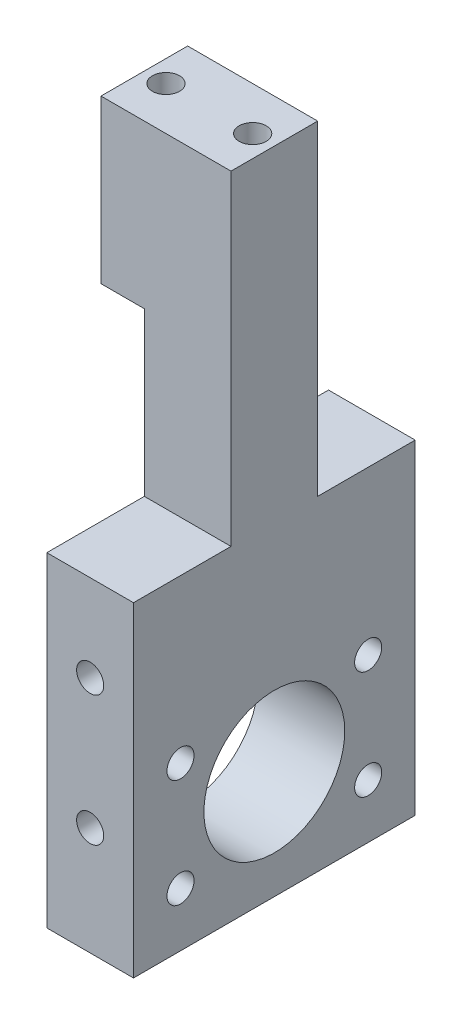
ISO-10303-21;
HEADER;
FILE_DESCRIPTION(('STEP AP214'),'2;1');
FILE_NAME('part.step','',(''),(''),'','','');
FILE_SCHEMA(('AUTOMOTIVE_DESIGN { 1 0 10303 214 1 1 1 1 }'));
ENDSEC;
DATA;
#1=APPLICATION_CONTEXT('core data for automotive mechanical design processes');
#2=APPLICATION_PROTOCOL_DEFINITION('international standard','automotive_design',2000,#1);
#3=PRODUCT_CONTEXT('',#1,'mechanical');
#4=PRODUCT('Part','Part','',(#3));
#5=PRODUCT_RELATED_PRODUCT_CATEGORY('part','',(#4));
#6=PRODUCT_DEFINITION_FORMATION('','',#4);
#7=PRODUCT_DEFINITION_CONTEXT('part definition',#1,'design');
#8=PRODUCT_DEFINITION('design','',#6,#7);
#9=PRODUCT_DEFINITION_SHAPE('','',#8);
#10=(LENGTH_UNIT() NAMED_UNIT(*) SI_UNIT(.MILLI.,.METRE.));
#11=(NAMED_UNIT(*) PLANE_ANGLE_UNIT() SI_UNIT($,.RADIAN.));
#12=(NAMED_UNIT(*) SI_UNIT($,.STERADIAN.) SOLID_ANGLE_UNIT());
#13=UNCERTAINTY_MEASURE_WITH_UNIT(LENGTH_MEASURE(1.E-05),#10,'distance_accuracy_value','');
#14=(GEOMETRIC_REPRESENTATION_CONTEXT(3) GLOBAL_UNCERTAINTY_ASSIGNED_CONTEXT((#13)) GLOBAL_UNIT_ASSIGNED_CONTEXT((#10,
#11,#12)) REPRESENTATION_CONTEXT('',''));
#15=CARTESIAN_POINT('',(0.,0.,0.));
#16=DIRECTION('',(0.,0.,1.));
#17=DIRECTION('',(1.,0.,0.));
#18=AXIS2_PLACEMENT_3D('',#15,#16,#17);
#19=CARTESIAN_POINT('',(12.,0.,0.));
#20=DIRECTION('',(1.,0.,0.));
#21=DIRECTION('',(0.,0.,-1.));
#22=AXIS2_PLACEMENT_3D('',#19,#20,#21);
#23=PLANE('',#22);
#24=CARTESIAN_POINT('',(12.,5.00000000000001,8.6602540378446));
#25=DIRECTION('',(1.,0.,0.));
#26=DIRECTION('',(0.,0.,-1.));
#27=AXIS2_PLACEMENT_3D('',#24,#25,#26);
#28=CIRCLE('',#27,1.24999999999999);
#29=CARTESIAN_POINT('',(12.,5.00000000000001,7.41025403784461));
#30=VERTEX_POINT('',#29);
#31=EDGE_CURVE('E171',#30,#30,#28,.T.);
#32=ORIENTED_EDGE('',*,*,#31,.F.);
#33=EDGE_LOOP('',(#32));
#34=FACE_BOUND('',#33,.T.);
#35=CARTESIAN_POINT('',(12.,-5.00000000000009,8.66025403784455));
#36=DIRECTION('',(1.,0.,0.));
#37=DIRECTION('',(0.,0.,-1.));
#38=AXIS2_PLACEMENT_3D('',#35,#36,#37);
#39=CIRCLE('',#38,1.24999999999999);
#40=CARTESIAN_POINT('',(12.,-5.00000000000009,7.41025403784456));
#41=VERTEX_POINT('',#40);
#42=EDGE_CURVE('E168',#41,#41,#39,.T.);
#43=ORIENTED_EDGE('',*,*,#42,.F.);
#44=EDGE_LOOP('',(#43));
#45=FACE_BOUND('',#44,.T.);
#46=CARTESIAN_POINT('',(12.,-5.,-8.6602540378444));
#47=DIRECTION('',(1.,0.,0.));
#48=DIRECTION('',(0.,0.,-1.));
#49=AXIS2_PLACEMENT_3D('',#46,#47,#48);
#50=CIRCLE('',#49,1.24999999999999);
#51=CARTESIAN_POINT('',(12.,-5.,-9.91025403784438));
#52=VERTEX_POINT('',#51);
#53=EDGE_CURVE('E165',#52,#52,#50,.T.);
#54=ORIENTED_EDGE('',*,*,#53,.F.);
#55=EDGE_LOOP('',(#54));
#56=FACE_BOUND('',#55,.T.);
#57=CARTESIAN_POINT('',(12.,5.,-8.6602540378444));
#58=DIRECTION('',(1.,0.,0.));
#59=DIRECTION('',(0.,0.,-1.));
#60=AXIS2_PLACEMENT_3D('',#57,#58,#59);
#61=CIRCLE('',#60,1.24999999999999);
#62=CARTESIAN_POINT('',(12.,5.,-9.91025403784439));
#63=VERTEX_POINT('',#62);
#64=EDGE_CURVE('E161',#63,#63,#61,.T.);
#65=ORIENTED_EDGE('',*,*,#64,.F.);
#66=EDGE_LOOP('',(#65));
#67=FACE_BOUND('',#66,.T.);
#68=DIRECTION('',(0.,-1.,0.));
#69=VECTOR('',#68,1.);
#70=CARTESIAN_POINT('',(12.,20.,13.));
#71=LINE('',#70,#69);
#72=CARTESIAN_POINT('',(12.,20.,13.));
#73=VERTEX_POINT('',#72);
#74=CARTESIAN_POINT('',(12.,-10.,13.));
#75=VERTEX_POINT('',#74);
#76=EDGE_CURVE('E137',#73,#75,#71,.T.);
#77=ORIENTED_EDGE('',*,*,#76,.T.);
#78=DIRECTION('',(0.,0.,-1.));
#79=VECTOR('',#78,1.);
#80=CARTESIAN_POINT('',(12.,-10.,13.));
#81=LINE('',#80,#79);
#82=CARTESIAN_POINT('',(12.,-10.,-13.));
#83=VERTEX_POINT('',#82);
#84=EDGE_CURVE('E91',#75,#83,#81,.T.);
#85=ORIENTED_EDGE('',*,*,#84,.T.);
#86=DIRECTION('',(0.,1.,0.));
#87=VECTOR('',#86,1.);
#88=CARTESIAN_POINT('',(12.,20.,-13.));
#89=LINE('',#88,#87);
#90=CARTESIAN_POINT('',(12.,20.,-13.));
#91=VERTEX_POINT('',#90);
#92=EDGE_CURVE('E229',#83,#91,#89,.T.);
#93=ORIENTED_EDGE('',*,*,#92,.T.);
#94=DIRECTION('',(0.,0.,1.));
#95=VECTOR('',#94,1.);
#96=CARTESIAN_POINT('',(12.,20.,-4.));
#97=LINE('',#96,#95);
#98=CARTESIAN_POINT('',(12.,20.,-4.));
#99=VERTEX_POINT('',#98);
#100=EDGE_CURVE('E231',#91,#99,#97,.T.);
#101=ORIENTED_EDGE('',*,*,#100,.T.);
#102=DIRECTION('',(0.,1.,0.));
#103=VECTOR('',#102,1.);
#104=CARTESIAN_POINT('',(12.,50.,-4.));
#105=LINE('',#104,#103);
#106=CARTESIAN_POINT('',(12.,50.,-4.));
#107=VERTEX_POINT('',#106);
#108=EDGE_CURVE('E112',#99,#107,#105,.T.);
#109=ORIENTED_EDGE('',*,*,#108,.T.);
#110=DIRECTION('',(0.,0.,1.));
#111=VECTOR('',#110,1.);
#112=CARTESIAN_POINT('',(12.,50.,4.));
#113=LINE('',#112,#111);
#114=CARTESIAN_POINT('',(12.,50.,4.));
#115=VERTEX_POINT('',#114);
#116=EDGE_CURVE('E106',#107,#115,#113,.T.);
#117=ORIENTED_EDGE('',*,*,#116,.T.);
#118=DIRECTION('',(0.,-1.,0.));
#119=VECTOR('',#118,1.);
#120=CARTESIAN_POINT('',(12.,20.,4.));
#121=LINE('',#120,#119);
#122=CARTESIAN_POINT('',(12.,20.,4.));
#123=VERTEX_POINT('',#122);
#124=EDGE_CURVE('E109',#115,#123,#121,.T.);
#125=ORIENTED_EDGE('',*,*,#124,.T.);
#126=DIRECTION('',(0.,0.,1.));
#127=VECTOR('',#126,1.);
#128=CARTESIAN_POINT('',(12.,20.,13.));
#129=LINE('',#128,#127);
#130=EDGE_CURVE('E66',#123,#73,#129,.T.);
#131=ORIENTED_EDGE('',*,*,#130,.T.);
#132=EDGE_LOOP('',(#77,#85,#93,#101,#109,#117,#125,#131));
#133=FACE_BOUND('',#132,.T.);
#134=CARTESIAN_POINT('',(12.,0.,0.));
#135=DIRECTION('',(1.,0.,0.));
#136=DIRECTION('',(0.,0.,-1.));
#137=AXIS2_PLACEMENT_3D('',#134,#135,#136);
#138=CIRCLE('',#137,6.5);
#139=CARTESIAN_POINT('',(12.,0.,-6.5));
#140=VERTEX_POINT('',#139);
#141=EDGE_CURVE('E133',#140,#140,#138,.T.);
#142=ORIENTED_EDGE('',*,*,#141,.F.);
#143=EDGE_LOOP('',(#142));
#144=FACE_BOUND('',#143,.T.);
#145=ADVANCED_FACE('F36',(#34,#45,#56,#67,#133,#144),#23,.T.);
#146=CARTESIAN_POINT('',(0.,0.,0.));
#147=DIRECTION('',(1.,0.,0.));
#148=DIRECTION('',(0.,0.,-1.));
#149=AXIS2_PLACEMENT_3D('',#146,#147,#148);
#150=PLANE('',#149);
#151=DIRECTION('',(0.,1.,0.));
#152=VECTOR('',#151,1.);
#153=CARTESIAN_POINT('',(0.,50.,-4.));
#154=LINE('',#153,#152);
#155=CARTESIAN_POINT('',(0.,35.,-4.));
#156=VERTEX_POINT('',#155);
#157=CARTESIAN_POINT('',(0.,50.,-4.));
#158=VERTEX_POINT('',#157);
#159=EDGE_CURVE('E131',#156,#158,#154,.T.);
#160=ORIENTED_EDGE('',*,*,#159,.F.);
#161=DIRECTION('',(0.,0.,-1.));
#162=VECTOR('',#161,1.);
#163=CARTESIAN_POINT('',(0.,35.,13.));
#164=LINE('',#163,#162);
#165=CARTESIAN_POINT('',(0.,35.,4.));
#166=VERTEX_POINT('',#165);
#167=EDGE_CURVE('E191',#166,#156,#164,.T.);
#168=ORIENTED_EDGE('',*,*,#167,.F.);
#169=DIRECTION('',(0.,-1.,0.));
#170=VECTOR('',#169,1.);
#171=CARTESIAN_POINT('',(0.,20.,4.));
#172=LINE('',#171,#170);
#173=CARTESIAN_POINT('',(0.,50.,4.));
#174=VERTEX_POINT('',#173);
#175=EDGE_CURVE('E135',#174,#166,#172,.T.);
#176=ORIENTED_EDGE('',*,*,#175,.F.);
#177=DIRECTION('',(0.,0.,1.));
#178=VECTOR('',#177,1.);
#179=CARTESIAN_POINT('',(0.,50.,4.));
#180=LINE('',#179,#178);
#181=EDGE_CURVE('E82',#158,#174,#180,.T.);
#182=ORIENTED_EDGE('',*,*,#181,.F.);
#183=EDGE_LOOP('',(#160,#168,#176,#182));
#184=FACE_BOUND('',#183,.T.);
#185=ADVANCED_FACE('F244',(#184),#150,.F.);
#186=CARTESIAN_POINT('',(12.,20.,13.));
#187=DIRECTION('',(0.,0.,-1.));
#188=DIRECTION('',(0.,1.,0.));
#189=AXIS2_PLACEMENT_3D('',#186,#187,#188);
#190=PLANE('',#189);
#191=CARTESIAN_POINT('',(8.00000000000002,0.,13.));
#192=DIRECTION('',(0.,0.,1.));
#193=DIRECTION('',(1.,0.,0.));
#194=AXIS2_PLACEMENT_3D('',#191,#192,#193);
#195=CIRCLE('',#194,1.24999999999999);
#196=CARTESIAN_POINT('',(9.25000000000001,0.,13.));
#197=VERTEX_POINT('',#196);
#198=EDGE_CURVE('E335',#197,#197,#195,.T.);
#199=ORIENTED_EDGE('',*,*,#198,.F.);
#200=EDGE_LOOP('',(#199));
#201=FACE_BOUND('',#200,.T.);
#202=CARTESIAN_POINT('',(8.00000000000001,12.,13.));
#203=DIRECTION('',(0.,0.,1.));
#204=DIRECTION('',(1.,0.,0.));
#205=AXIS2_PLACEMENT_3D('',#202,#203,#204);
#206=CIRCLE('',#205,1.24999999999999);
#207=CARTESIAN_POINT('',(9.25,12.,13.));
#208=VERTEX_POINT('',#207);
#209=EDGE_CURVE('E182',#208,#208,#206,.T.);
#210=ORIENTED_EDGE('',*,*,#209,.F.);
#211=EDGE_LOOP('',(#210));
#212=FACE_BOUND('',#211,.T.);
#213=DIRECTION('',(-1.,0.,0.));
#214=VECTOR('',#213,1.);
#215=CARTESIAN_POINT('',(12.,20.,13.));
#216=LINE('',#215,#214);
#217=CARTESIAN_POINT('',(4.,20.,13.));
#218=VERTEX_POINT('',#217);
#219=EDGE_CURVE('E127',#73,#218,#216,.T.);
#220=ORIENTED_EDGE('',*,*,#219,.T.);
#221=DIRECTION('',(0.,-1.,0.));
#222=VECTOR('',#221,1.);
#223=CARTESIAN_POINT('',(4.,-10.,13.));
#224=LINE('',#223,#222);
#225=CARTESIAN_POINT('',(4.,-10.,13.));
#226=VERTEX_POINT('',#225);
#227=EDGE_CURVE('E57',#218,#226,#224,.T.);
#228=ORIENTED_EDGE('',*,*,#227,.T.);
#229=DIRECTION('',(-1.,0.,0.));
#230=VECTOR('',#229,1.);
#231=CARTESIAN_POINT('',(12.,-10.,13.));
#232=LINE('',#231,#230);
#233=EDGE_CURVE('E49',#75,#226,#232,.T.);
#234=ORIENTED_EDGE('',*,*,#233,.F.);
#235=ORIENTED_EDGE('',*,*,#76,.F.);
#236=EDGE_LOOP('',(#220,#228,#234,#235));
#237=FACE_BOUND('',#236,.T.);
#238=ADVANCED_FACE('F38',(#201,#212,#237),#190,.F.);
#239=CARTESIAN_POINT('',(12.,-10.,13.));
#240=DIRECTION('',(0.,1.,0.));
#241=DIRECTION('',(0.,0.,1.));
#242=AXIS2_PLACEMENT_3D('',#239,#240,#241);
#243=PLANE('',#242);
#244=ORIENTED_EDGE('',*,*,#233,.T.);
#245=DIRECTION('',(0.,0.,-1.));
#246=VECTOR('',#245,1.);
#247=CARTESIAN_POINT('',(4.,-10.,13.));
#248=LINE('',#247,#246);
#249=CARTESIAN_POINT('',(4.,-10.,-13.));
#250=VERTEX_POINT('',#249);
#251=EDGE_CURVE('E155',#226,#250,#248,.T.);
#252=ORIENTED_EDGE('',*,*,#251,.T.);
#253=DIRECTION('',(-1.,0.,0.));
#254=VECTOR('',#253,1.);
#255=CARTESIAN_POINT('',(12.,-10.,-13.));
#256=LINE('',#255,#254);
#257=EDGE_CURVE('E148',#83,#250,#256,.T.);
#258=ORIENTED_EDGE('',*,*,#257,.F.);
#259=ORIENTED_EDGE('',*,*,#84,.F.);
#260=EDGE_LOOP('',(#244,#252,#258,#259));
#261=FACE_BOUND('',#260,.T.);
#262=ADVANCED_FACE('F342',(#261),#243,.F.);
#263=CARTESIAN_POINT('',(12.,20.,-13.));
#264=DIRECTION('',(0.,0.,1.));
#265=DIRECTION('',(1.,0.,0.));
#266=AXIS2_PLACEMENT_3D('',#263,#264,#265);
#267=PLANE('',#266);
#268=ORIENTED_EDGE('',*,*,#257,.T.);
#269=DIRECTION('',(0.,-1.,0.));
#270=VECTOR('',#269,1.);
#271=CARTESIAN_POINT('',(4.,-10.,-13.));
#272=LINE('',#271,#270);
#273=CARTESIAN_POINT('',(4.,20.,-13.));
#274=VERTEX_POINT('',#273);
#275=EDGE_CURVE('E160',#274,#250,#272,.T.);
#276=ORIENTED_EDGE('',*,*,#275,.F.);
#277=DIRECTION('',(-1.,0.,0.));
#278=VECTOR('',#277,1.);
#279=CARTESIAN_POINT('',(12.,20.,-13.));
#280=LINE('',#279,#278);
#281=EDGE_CURVE('E145',#91,#274,#280,.T.);
#282=ORIENTED_EDGE('',*,*,#281,.F.);
#283=ORIENTED_EDGE('',*,*,#92,.F.);
#284=EDGE_LOOP('',(#268,#276,#282,#283));
#285=FACE_BOUND('',#284,.T.);
#286=ADVANCED_FACE('F348',(#285),#267,.F.);
#287=CARTESIAN_POINT('',(12.,20.,-4.));
#288=DIRECTION('',(0.,-1.,0.));
#289=DIRECTION('',(0.,0.,-1.));
#290=AXIS2_PLACEMENT_3D('',#287,#288,#289);
#291=PLANE('',#290);
#292=ORIENTED_EDGE('',*,*,#281,.T.);
#293=DIRECTION('',(0.,0.,1.));
#294=VECTOR('',#293,1.);
#295=CARTESIAN_POINT('',(4.,20.,-4.));
#296=LINE('',#295,#294);
#297=CARTESIAN_POINT('',(4.,20.,-4.));
#298=VERTEX_POINT('',#297);
#299=EDGE_CURVE('E207',#274,#298,#296,.T.);
#300=ORIENTED_EDGE('',*,*,#299,.T.);
#301=DIRECTION('',(-1.,0.,0.));
#302=VECTOR('',#301,1.);
#303=CARTESIAN_POINT('',(12.,20.,-4.));
#304=LINE('',#303,#302);
#305=EDGE_CURVE('E142',#99,#298,#304,.T.);
#306=ORIENTED_EDGE('',*,*,#305,.F.);
#307=ORIENTED_EDGE('',*,*,#100,.F.);
#308=EDGE_LOOP('',(#292,#300,#306,#307));
#309=FACE_BOUND('',#308,.T.);
#310=ADVANCED_FACE('F237',(#309),#291,.F.);
#311=CARTESIAN_POINT('',(12.,50.,-4.));
#312=DIRECTION('',(0.,0.,1.));
#313=DIRECTION('',(0.,-1.,0.));
#314=AXIS2_PLACEMENT_3D('',#311,#312,#313);
#315=PLANE('',#314);
#316=ORIENTED_EDGE('',*,*,#305,.T.);
#317=DIRECTION('',(0.,1.,0.));
#318=VECTOR('',#317,1.);
#319=CARTESIAN_POINT('',(4.,50.,-4.));
#320=LINE('',#319,#318);
#321=CARTESIAN_POINT('',(4.,35.,-4.));
#322=VERTEX_POINT('',#321);
#323=EDGE_CURVE('E204',#298,#322,#320,.T.);
#324=ORIENTED_EDGE('',*,*,#323,.T.);
#325=DIRECTION('',(-1.,0.,0.));
#326=VECTOR('',#325,1.);
#327=CARTESIAN_POINT('',(12.,35.,-4.));
#328=LINE('',#327,#326);
#329=EDGE_CURVE('E210',#322,#156,#328,.T.);
#330=ORIENTED_EDGE('',*,*,#329,.T.);
#331=ORIENTED_EDGE('',*,*,#159,.T.);
#332=DIRECTION('',(-1.,0.,0.));
#333=VECTOR('',#332,1.);
#334=CARTESIAN_POINT('',(12.,50.,-4.));
#335=LINE('',#334,#333);
#336=EDGE_CURVE('E120',#107,#158,#335,.T.);
#337=ORIENTED_EDGE('',*,*,#336,.F.);
#338=ORIENTED_EDGE('',*,*,#108,.F.);
#339=EDGE_LOOP('',(#316,#324,#330,#331,#337,#338));
#340=FACE_BOUND('',#339,.T.);
#341=ADVANCED_FACE('F241',(#340),#315,.F.);
#342=CARTESIAN_POINT('',(12.,50.,4.));
#343=DIRECTION('',(0.,-1.,0.));
#344=DIRECTION('',(0.,0.,-1.));
#345=AXIS2_PLACEMENT_3D('',#342,#343,#344);
#346=PLANE('',#345);
#347=CARTESIAN_POINT('',(2.,50.,0.));
#348=DIRECTION('',(0.,1.,0.));
#349=DIRECTION('',(0.,0.,1.));
#350=AXIS2_PLACEMENT_3D('',#347,#348,#349);
#351=CIRCLE('',#350,1.25);
#352=CARTESIAN_POINT('',(2.,50.,1.25));
#353=VERTEX_POINT('',#352);
#354=EDGE_CURVE('E213',#353,#353,#351,.T.);
#355=ORIENTED_EDGE('',*,*,#354,.F.);
#356=EDGE_LOOP('',(#355));
#357=FACE_BOUND('',#356,.T.);
#358=CARTESIAN_POINT('',(10.,50.,0.));
#359=DIRECTION('',(0.,1.,0.));
#360=DIRECTION('',(0.,0.,1.));
#361=AXIS2_PLACEMENT_3D('',#358,#359,#360);
#362=CIRCLE('',#361,1.25);
#363=CARTESIAN_POINT('',(10.,50.,1.25));
#364=VERTEX_POINT('',#363);
#365=EDGE_CURVE('E219',#364,#364,#362,.T.);
#366=ORIENTED_EDGE('',*,*,#365,.F.);
#367=EDGE_LOOP('',(#366));
#368=FACE_BOUND('',#367,.T.);
#369=ORIENTED_EDGE('',*,*,#181,.T.);
#370=DIRECTION('',(-1.,0.,0.));
#371=VECTOR('',#370,1.);
#372=CARTESIAN_POINT('',(12.,50.,4.));
#373=LINE('',#372,#371);
#374=EDGE_CURVE('E115',#115,#174,#373,.T.);
#375=ORIENTED_EDGE('',*,*,#374,.F.);
#376=ORIENTED_EDGE('',*,*,#116,.F.);
#377=ORIENTED_EDGE('',*,*,#336,.T.);
#378=EDGE_LOOP('',(#369,#375,#376,#377));
#379=FACE_BOUND('',#378,.T.);
#380=ADVANCED_FACE('F116',(#357,#368,#379),#346,.F.);
#381=CARTESIAN_POINT('',(12.,20.,4.));
#382=DIRECTION('',(0.,0.,-1.));
#383=DIRECTION('',(0.,1.,0.));
#384=AXIS2_PLACEMENT_3D('',#381,#382,#383);
#385=PLANE('',#384);
#386=DIRECTION('',(1.,0.,0.));
#387=VECTOR('',#386,1.);
#388=CARTESIAN_POINT('',(12.,35.,4.));
#389=LINE('',#388,#387);
#390=CARTESIAN_POINT('',(4.,35.,4.));
#391=VERTEX_POINT('',#390);
#392=EDGE_CURVE('E11',#166,#391,#389,.T.);
#393=ORIENTED_EDGE('',*,*,#392,.T.);
#394=DIRECTION('',(0.,-1.,0.));
#395=VECTOR('',#394,1.);
#396=CARTESIAN_POINT('',(4.,20.,4.));
#397=LINE('',#396,#395);
#398=CARTESIAN_POINT('',(4.,20.,4.));
#399=VERTEX_POINT('',#398);
#400=EDGE_CURVE('E202',#391,#399,#397,.T.);
#401=ORIENTED_EDGE('',*,*,#400,.T.);
#402=DIRECTION('',(-1.,0.,0.));
#403=VECTOR('',#402,1.);
#404=CARTESIAN_POINT('',(12.,20.,4.));
#405=LINE('',#404,#403);
#406=EDGE_CURVE('E121',#123,#399,#405,.T.);
#407=ORIENTED_EDGE('',*,*,#406,.F.);
#408=ORIENTED_EDGE('',*,*,#124,.F.);
#409=ORIENTED_EDGE('',*,*,#374,.T.);
#410=ORIENTED_EDGE('',*,*,#175,.T.);
#411=EDGE_LOOP('',(#393,#401,#407,#408,#409,#410));
#412=FACE_BOUND('',#411,.T.);
#413=ADVANCED_FACE('F123',(#412),#385,.F.);
#414=CARTESIAN_POINT('',(12.,20.,13.));
#415=DIRECTION('',(0.,-1.,0.));
#416=DIRECTION('',(0.,0.,-1.));
#417=AXIS2_PLACEMENT_3D('',#414,#415,#416);
#418=PLANE('',#417);
#419=ORIENTED_EDGE('',*,*,#406,.T.);
#420=DIRECTION('',(0.,0.,1.));
#421=VECTOR('',#420,1.);
#422=CARTESIAN_POINT('',(4.,20.,13.));
#423=LINE('',#422,#421);
#424=EDGE_CURVE('E154',#399,#218,#423,.T.);
#425=ORIENTED_EDGE('',*,*,#424,.T.);
#426=ORIENTED_EDGE('',*,*,#219,.F.);
#427=ORIENTED_EDGE('',*,*,#130,.F.);
#428=EDGE_LOOP('',(#419,#425,#426,#427));
#429=FACE_BOUND('',#428,.T.);
#430=ADVANCED_FACE('F284',(#429),#418,.F.);
#431=CARTESIAN_POINT('',(12.,0.,0.));
#432=DIRECTION('',(-1.,0.,0.));
#433=DIRECTION('',(0.,0.,1.));
#434=AXIS2_PLACEMENT_3D('',#431,#432,#433);
#435=CYLINDRICAL_SURFACE('',#434,6.5);
#436=CARTESIAN_POINT('',(9.25000000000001,0.,6.5));
#437=CARTESIAN_POINT('',(9.24999737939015,-0.0695263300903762,6.49999873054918));
#438=CARTESIAN_POINT('',(9.24417970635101,-0.139086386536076,6.49887299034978));
#439=CARTESIAN_POINT('',(9.2210790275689,-0.276244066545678,6.49449072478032));
#440=CARTESIAN_POINT('',(9.203786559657,-0.343840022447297,6.49123244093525));
#441=CARTESIAN_POINT('',(9.15828720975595,-0.475066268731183,6.48294932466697));
#442=CARTESIAN_POINT('',(9.1300904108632,-0.538700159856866,6.47792612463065));
#443=CARTESIAN_POINT('',(9.06361193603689,-0.660328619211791,6.46666077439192));
#444=CARTESIAN_POINT('',(9.02533099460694,-0.71832359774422,6.46041871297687));
#445=CARTESIAN_POINT('',(8.93926041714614,-0.827762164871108,6.44731615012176));
#446=CARTESIAN_POINT('',(8.89136858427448,-0.879124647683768,6.44044947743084));
#447=CARTESIAN_POINT('',(8.7876554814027,-0.973138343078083,6.42691706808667));
#448=CARTESIAN_POINT('',(8.73183362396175,-1.01578890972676,6.42025134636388));
#449=CARTESIAN_POINT('',(8.61326800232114,-1.09150839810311,6.4078154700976));
#450=CARTESIAN_POINT('',(8.55047028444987,-1.12449425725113,6.40205326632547));
#451=CARTESIAN_POINT('',(8.42009504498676,-1.17941610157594,6.39216406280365));
#452=CARTESIAN_POINT('',(8.35251795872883,-1.2013530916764,6.38803691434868));
#453=CARTESIAN_POINT('',(8.21537190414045,-1.2332930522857,6.38194735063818));
#454=CARTESIAN_POINT('',(8.14583711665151,-1.24343779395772,6.37995924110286));
#455=CARTESIAN_POINT('',(8.00602618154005,-1.25194545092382,6.37829543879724));
#456=CARTESIAN_POINT('',(7.93575010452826,-1.25030947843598,6.37861952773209));
#457=CARTESIAN_POINT('',(7.79748238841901,-1.23541697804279,6.38152012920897));
#458=CARTESIAN_POINT('',(7.72947257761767,-1.22232215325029,6.38406529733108));
#459=CARTESIAN_POINT('',(7.59663350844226,-1.18513854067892,6.39107200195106));
#460=CARTESIAN_POINT('',(7.53180439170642,-1.16104926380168,6.39553362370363));
#461=CARTESIAN_POINT('',(7.4066965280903,-1.10240382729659,6.40590301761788));
#462=CARTESIAN_POINT('',(7.34644894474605,-1.06778282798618,6.41181970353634));
#463=CARTESIAN_POINT('',(7.23255751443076,-0.989102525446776,6.42442673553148));
#464=CARTESIAN_POINT('',(7.17891437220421,-0.945042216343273,6.43111716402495));
#465=CARTESIAN_POINT('',(7.07882073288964,-0.847864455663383,6.44465411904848));
#466=CARTESIAN_POINT('',(7.03250440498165,-0.794608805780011,6.45150139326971));
#467=CARTESIAN_POINT('',(6.94944224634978,-0.681013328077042,6.46447860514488));
#468=CARTESIAN_POINT('',(6.91269652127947,-0.620673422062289,6.47060853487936));
#469=CARTESIAN_POINT('',(6.84979697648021,-0.49447888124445,6.48147374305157));
#470=CARTESIAN_POINT('',(6.82365763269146,-0.428616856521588,6.48620711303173));
#471=CARTESIAN_POINT('',(6.78285128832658,-0.293325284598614,6.49373123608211));
#472=CARTESIAN_POINT('',(6.76818300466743,-0.223896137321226,6.49652220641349));
#473=CARTESIAN_POINT('',(6.75092311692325,-0.084594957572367,6.4998170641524));
#474=CARTESIAN_POINT('',(6.74814776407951,-0.0147464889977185,6.50035574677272));
#475=CARTESIAN_POINT('',(6.75425888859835,0.124416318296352,6.49918164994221));
#476=CARTESIAN_POINT('',(6.7631447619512,0.193730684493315,6.49746898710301));
#477=CARTESIAN_POINT('',(6.79217337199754,0.32927112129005,6.49200634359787));
#478=CARTESIAN_POINT('',(6.8122226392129,0.395517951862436,6.48827328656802));
#479=CARTESIAN_POINT('',(6.86290739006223,0.523709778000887,6.47918677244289));
#480=CARTESIAN_POINT('',(6.89354362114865,0.585654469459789,6.47383320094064));
#481=CARTESIAN_POINT('',(6.96493587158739,0.704264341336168,6.46201273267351));
#482=CARTESIAN_POINT('',(7.00580354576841,0.760861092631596,6.4555338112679));
#483=CARTESIAN_POINT('',(7.09634811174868,0.866459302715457,6.44221127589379));
#484=CARTESIAN_POINT('',(7.14602587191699,0.915460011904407,6.43536762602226));
#485=CARTESIAN_POINT('',(7.25361408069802,1.00517755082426,6.42197081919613));
#486=CARTESIAN_POINT('',(7.31163012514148,1.04576869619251,6.41542307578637));
#487=CARTESIAN_POINT('',(7.43376516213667,1.11662974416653,6.40347051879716));
#488=CARTESIAN_POINT('',(7.49788392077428,1.14690004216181,6.39806566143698));
#489=CARTESIAN_POINT('',(7.63009317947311,1.19608442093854,6.38905378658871));
#490=CARTESIAN_POINT('',(7.69816206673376,1.21505488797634,6.38543785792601));
#491=CARTESIAN_POINT('',(7.83659753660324,1.24127395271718,6.38039343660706));
#492=CARTESIAN_POINT('',(7.90696384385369,1.2485239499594,6.37896468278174));
#493=CARTESIAN_POINT('',(8.04673667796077,1.2510475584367,6.37847010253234));
#494=CARTESIAN_POINT('',(8.1161395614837,1.246519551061,6.37936513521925));
#495=CARTESIAN_POINT('',(8.25317497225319,1.22605133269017,6.3833302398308));
#496=CARTESIAN_POINT('',(8.32080751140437,1.21011119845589,6.38640029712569));
#497=CARTESIAN_POINT('',(8.45226830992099,1.16735673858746,6.39435266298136));
#498=CARTESIAN_POINT('',(8.51610414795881,1.14056497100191,6.39923121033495));
#499=CARTESIAN_POINT('',(8.63840618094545,1.07688985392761,6.4102533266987));
#500=CARTESIAN_POINT('',(8.69687196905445,1.04000574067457,6.41639699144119));
#501=CARTESIAN_POINT('',(8.8077657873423,0.956507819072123,6.42937795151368));
#502=CARTESIAN_POINT('',(8.86008434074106,0.909750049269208,6.43622463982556));
#503=CARTESIAN_POINT('',(8.95619868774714,0.808131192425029,6.44977101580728));
#504=CARTESIAN_POINT('',(8.99999252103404,0.75326824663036,6.45647066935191));
#505=CARTESIAN_POINT('',(9.07820650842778,0.636368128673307,6.46904328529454));
#506=CARTESIAN_POINT('',(9.11253318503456,0.574267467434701,6.47490774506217));
#507=CARTESIAN_POINT('',(9.17021039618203,0.445086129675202,6.48506595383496));
#508=CARTESIAN_POINT('',(9.19357108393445,0.378010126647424,6.48936115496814));
#509=CARTESIAN_POINT('',(9.22399229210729,0.25896178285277,6.49503671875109));
#510=CARTESIAN_POINT('',(9.23372824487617,0.207678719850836,6.49688729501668));
#511=CARTESIAN_POINT('',(9.24673299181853,0.104270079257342,6.49936939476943));
#512=CARTESIAN_POINT('',(9.25000196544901,0.0521445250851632,6.50000095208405));
#513=CARTESIAN_POINT('',(9.25000000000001,0.,6.5));
#514=B_SPLINE_CURVE_WITH_KNOTS('',3,(#436,#437,#438,#439,#440,#441,#442,#443,#444,#445,#446,
#447,#448,#449,#450,#451,#452,#453,#454,#455,#456,#457,#458,#459,#460,#461,#462,#463,#464,#465,
#466,#467,#468,#469,#470,#471,#472,#473,#474,#475,#476,#477,#478,#479,#480,#481,#482,#483,#484,
#485,#486,#487,#488,#489,#490,#491,#492,#493,#494,#495,#496,#497,#498,#499,#500,#501,#502,#503,
#504,#505,#506,#507,#508,#509,#510,#511,#512,#513),.UNSPECIFIED.,.T.,.F.,(4,2,2,2,2,2,2,2,2,2,2,
2,2,2,2,2,2,2,2,2,2,2,2,2,2,2,2,2,2,2,2,2,2,2,2,2,2,2,4),(0.,0.208388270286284,
0.416948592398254,0.62531652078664,0.833669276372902,1.04436766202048,1.2550816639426,
1.46755680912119,1.68001262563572,1.88988689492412,2.09974135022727,2.30668132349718,
2.51363050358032,2.72188049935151,2.93015269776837,3.14188196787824,3.35361357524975,
3.56563319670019,3.77762909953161,3.98633752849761,4.19503514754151,4.40201109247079,
4.60900165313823,4.81835785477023,5.02773470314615,5.24004512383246,5.4523474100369,
5.66358123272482,5.87478983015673,6.08246408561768,6.29013694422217,6.4973802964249,
6.70463933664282,6.91515952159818,7.12572806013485,7.33830680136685,7.55068832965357,
7.70698320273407,7.86327373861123),.UNSPECIFIED.);
#515=CARTESIAN_POINT('',(9.25000000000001,0.,6.5));
#516=VERTEX_POINT('',#515);
#517=EDGE_CURVE('E40',#516,#516,#514,.T.);
#518=ORIENTED_EDGE('',*,*,#517,.F.);
#519=EDGE_LOOP('',(#518));
#520=FACE_BOUND('',#519,.T.);
#521=CARTESIAN_POINT('',(4.,0.,0.));
#522=DIRECTION('',(1.,0.,0.));
#523=DIRECTION('',(0.,0.,-1.));
#524=AXIS2_PLACEMENT_3D('',#521,#522,#523);
#525=CIRCLE('',#524,6.5);
#526=CARTESIAN_POINT('',(4.,0.,-6.5));
#527=VERTEX_POINT('',#526);
#528=EDGE_CURVE('E152',#527,#527,#525,.T.);
#529=ORIENTED_EDGE('',*,*,#528,.F.);
#530=EDGE_LOOP('',(#529));
#531=FACE_BOUND('',#530,.T.);
#532=ORIENTED_EDGE('',*,*,#141,.T.);
#533=EDGE_LOOP('',(#532));
#534=FACE_BOUND('',#533,.T.);
#535=ADVANCED_FACE('F267',(#520,#531,#534),#435,.F.);
#536=CARTESIAN_POINT('',(10.,41.5,0.));
#537=DIRECTION('',(0.,1.,0.));
#538=DIRECTION('',(0.,0.,1.));
#539=AXIS2_PLACEMENT_3D('',#536,#537,#538);
#540=CONICAL_SURFACE('',#539,1.25,1.02974425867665);
#541=CARTESIAN_POINT('',(10.,40.7489242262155,0.));
#542=VERTEX_POINT('',#541);
#543=VERTEX_LOOP('',#542);
#544=FACE_BOUND('',#543,.T.);
#545=CARTESIAN_POINT('',(10.,41.5,0.));
#546=DIRECTION('',(0.,1.,0.));
#547=DIRECTION('',(0.,0.,1.));
#548=AXIS2_PLACEMENT_3D('',#545,#546,#547);
#549=CIRCLE('',#548,1.25);
#550=CARTESIAN_POINT('',(10.,41.5,1.25));
#551=VERTEX_POINT('',#550);
#552=EDGE_CURVE('E222',#551,#551,#549,.T.);
#553=ORIENTED_EDGE('',*,*,#552,.T.);
#554=EDGE_LOOP('',(#553));
#555=FACE_BOUND('',#554,.T.);
#556=ADVANCED_FACE('F263',(#544,#555),#540,.F.);
#557=CARTESIAN_POINT('',(10.,50.,0.));
#558=DIRECTION('',(0.,1.,0.));
#559=DIRECTION('',(0.,0.,1.));
#560=AXIS2_PLACEMENT_3D('',#557,#558,#559);
#561=CYLINDRICAL_SURFACE('',#560,1.25);
#562=ORIENTED_EDGE('',*,*,#552,.F.);
#563=EDGE_LOOP('',(#562));
#564=FACE_BOUND('',#563,.T.);
#565=ORIENTED_EDGE('',*,*,#365,.T.);
#566=EDGE_LOOP('',(#565));
#567=FACE_BOUND('',#566,.T.);
#568=ADVANCED_FACE('F266',(#564,#567),#561,.F.);
#569=CARTESIAN_POINT('',(2.,41.5,0.));
#570=DIRECTION('',(0.,1.,0.));
#571=DIRECTION('',(0.,0.,1.));
#572=AXIS2_PLACEMENT_3D('',#569,#570,#571);
#573=CONICAL_SURFACE('',#572,1.25,1.02974425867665);
#574=CARTESIAN_POINT('',(2.,40.7489242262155,0.));
#575=VERTEX_POINT('',#574);
#576=VERTEX_LOOP('',#575);
#577=FACE_BOUND('',#576,.T.);
#578=CARTESIAN_POINT('',(2.,41.5,0.));
#579=DIRECTION('',(0.,1.,0.));
#580=DIRECTION('',(0.,0.,1.));
#581=AXIS2_PLACEMENT_3D('',#578,#579,#580);
#582=CIRCLE('',#581,1.25);
#583=CARTESIAN_POINT('',(2.,41.5,1.25));
#584=VERTEX_POINT('',#583);
#585=EDGE_CURVE('E216',#584,#584,#582,.T.);
#586=ORIENTED_EDGE('',*,*,#585,.T.);
#587=EDGE_LOOP('',(#586));
#588=FACE_BOUND('',#587,.T.);
#589=ADVANCED_FACE('F273',(#577,#588),#573,.F.);
#590=CARTESIAN_POINT('',(2.,50.,0.));
#591=DIRECTION('',(0.,1.,0.));
#592=DIRECTION('',(0.,0.,1.));
#593=AXIS2_PLACEMENT_3D('',#590,#591,#592);
#594=CYLINDRICAL_SURFACE('',#593,1.25);
#595=ORIENTED_EDGE('',*,*,#585,.F.);
#596=EDGE_LOOP('',(#595));
#597=FACE_BOUND('',#596,.T.);
#598=ORIENTED_EDGE('',*,*,#354,.T.);
#599=EDGE_LOOP('',(#598));
#600=FACE_BOUND('',#599,.T.);
#601=ADVANCED_FACE('F352',(#597,#600),#594,.F.);
#602=CARTESIAN_POINT('',(0.,35.,13.));
#603=DIRECTION('',(0.,1.,0.));
#604=DIRECTION('',(0.,0.,1.));
#605=AXIS2_PLACEMENT_3D('',#602,#603,#604);
#606=PLANE('',#605);
#607=DIRECTION('',(0.,0.,-1.));
#608=VECTOR('',#607,1.);
#609=CARTESIAN_POINT('',(4.,35.,13.));
#610=LINE('',#609,#608);
#611=EDGE_CURVE('E196',#391,#322,#610,.T.);
#612=ORIENTED_EDGE('',*,*,#611,.F.);
#613=ORIENTED_EDGE('',*,*,#392,.F.);
#614=ORIENTED_EDGE('',*,*,#167,.T.);
#615=ORIENTED_EDGE('',*,*,#329,.F.);
#616=EDGE_LOOP('',(#612,#613,#614,#615));
#617=FACE_BOUND('',#616,.T.);
#618=ADVANCED_FACE('F350',(#617),#606,.F.);
#619=CARTESIAN_POINT('',(4.,-10.,13.));
#620=DIRECTION('',(1.,0.,0.));
#621=DIRECTION('',(0.,0.,-1.));
#622=AXIS2_PLACEMENT_3D('',#619,#620,#621);
#623=PLANE('',#622);
#624=CARTESIAN_POINT('',(4.,5.00000000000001,8.6602540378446));
#625=DIRECTION('',(1.,0.,0.));
#626=DIRECTION('',(0.,0.,-1.));
#627=AXIS2_PLACEMENT_3D('',#624,#625,#626);
#628=CIRCLE('',#627,1.24999999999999);
#629=CARTESIAN_POINT('',(4.,5.00000000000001,7.41025403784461));
#630=VERTEX_POINT('',#629);
#631=EDGE_CURVE('E169',#630,#630,#628,.T.);
#632=ORIENTED_EDGE('',*,*,#631,.T.);
#633=EDGE_LOOP('',(#632));
#634=FACE_BOUND('',#633,.T.);
#635=CARTESIAN_POINT('',(4.,-5.00000000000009,8.66025403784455));
#636=DIRECTION('',(1.,0.,0.));
#637=DIRECTION('',(0.,0.,-1.));
#638=AXIS2_PLACEMENT_3D('',#635,#636,#637);
#639=CIRCLE('',#638,1.24999999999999);
#640=CARTESIAN_POINT('',(4.,-5.00000000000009,7.41025403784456));
#641=VERTEX_POINT('',#640);
#642=EDGE_CURVE('E166',#641,#641,#639,.T.);
#643=ORIENTED_EDGE('',*,*,#642,.T.);
#644=EDGE_LOOP('',(#643));
#645=FACE_BOUND('',#644,.T.);
#646=CARTESIAN_POINT('',(4.,-5.,-8.6602540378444));
#647=DIRECTION('',(1.,0.,0.));
#648=DIRECTION('',(0.,0.,-1.));
#649=AXIS2_PLACEMENT_3D('',#646,#647,#648);
#650=CIRCLE('',#649,1.24999999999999);
#651=CARTESIAN_POINT('',(4.,-5.,-9.91025403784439));
#652=VERTEX_POINT('',#651);
#653=EDGE_CURVE('E162',#652,#652,#650,.T.);
#654=ORIENTED_EDGE('',*,*,#653,.T.);
#655=EDGE_LOOP('',(#654));
#656=FACE_BOUND('',#655,.T.);
#657=CARTESIAN_POINT('',(4.,5.,-8.6602540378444));
#658=DIRECTION('',(1.,0.,0.));
#659=DIRECTION('',(0.,0.,-1.));
#660=AXIS2_PLACEMENT_3D('',#657,#658,#659);
#661=CIRCLE('',#660,1.24999999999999);
#662=CARTESIAN_POINT('',(4.,5.,-9.9102540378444));
#663=VERTEX_POINT('',#662);
#664=EDGE_CURVE('E157',#663,#663,#661,.T.);
#665=ORIENTED_EDGE('',*,*,#664,.T.);
#666=EDGE_LOOP('',(#665));
#667=FACE_BOUND('',#666,.T.);
#668=ORIENTED_EDGE('',*,*,#528,.T.);
#669=EDGE_LOOP('',(#668));
#670=FACE_BOUND('',#669,.T.);
#671=ORIENTED_EDGE('',*,*,#275,.T.);
#672=ORIENTED_EDGE('',*,*,#251,.F.);
#673=ORIENTED_EDGE('',*,*,#227,.F.);
#674=ORIENTED_EDGE('',*,*,#424,.F.);
#675=ORIENTED_EDGE('',*,*,#400,.F.);
#676=ORIENTED_EDGE('',*,*,#611,.T.);
#677=ORIENTED_EDGE('',*,*,#323,.F.);
#678=ORIENTED_EDGE('',*,*,#299,.F.);
#679=EDGE_LOOP('',(#671,#672,#673,#674,#675,#676,#677,#678));
#680=FACE_BOUND('',#679,.T.);
#681=ADVANCED_FACE('F349',(#634,#645,#656,#667,#670,#680),#623,.F.);
#682=CARTESIAN_POINT('',(12.,5.,-8.6602540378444));
#683=DIRECTION('',(1.,0.,0.));
#684=DIRECTION('',(0.,0.,-1.));
#685=AXIS2_PLACEMENT_3D('',#682,#683,#684);
#686=CYLINDRICAL_SURFACE('',#685,1.24999999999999);
#687=ORIENTED_EDGE('',*,*,#64,.T.);
#688=EDGE_LOOP('',(#687));
#689=FACE_BOUND('',#688,.T.);
#690=ORIENTED_EDGE('',*,*,#664,.F.);
#691=EDGE_LOOP('',(#690));
#692=FACE_BOUND('',#691,.T.);
#693=ADVANCED_FACE('F358',(#689,#692),#686,.F.);
#694=CARTESIAN_POINT('',(12.,-5.,-8.6602540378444));
#695=DIRECTION('',(1.,0.,0.));
#696=DIRECTION('',(0.,0.,-1.));
#697=AXIS2_PLACEMENT_3D('',#694,#695,#696);
#698=CYLINDRICAL_SURFACE('',#697,1.24999999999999);
#699=ORIENTED_EDGE('',*,*,#53,.T.);
#700=EDGE_LOOP('',(#699));
#701=FACE_BOUND('',#700,.T.);
#702=ORIENTED_EDGE('',*,*,#653,.F.);
#703=EDGE_LOOP('',(#702));
#704=FACE_BOUND('',#703,.T.);
#705=ADVANCED_FACE('F404',(#701,#704),#698,.F.);
#706=CARTESIAN_POINT('',(12.,-5.00000000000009,8.66025403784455));
#707=DIRECTION('',(1.,0.,0.));
#708=DIRECTION('',(0.,0.,-1.));
#709=AXIS2_PLACEMENT_3D('',#706,#707,#708);
#710=CYLINDRICAL_SURFACE('',#709,1.24999999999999);
#711=ORIENTED_EDGE('',*,*,#42,.T.);
#712=EDGE_LOOP('',(#711));
#713=FACE_BOUND('',#712,.T.);
#714=ORIENTED_EDGE('',*,*,#642,.F.);
#715=EDGE_LOOP('',(#714));
#716=FACE_BOUND('',#715,.T.);
#717=ADVANCED_FACE('F414',(#713,#716),#710,.F.);
#718=CARTESIAN_POINT('',(12.,5.00000000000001,8.6602540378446));
#719=DIRECTION('',(1.,0.,0.));
#720=DIRECTION('',(0.,0.,-1.));
#721=AXIS2_PLACEMENT_3D('',#718,#719,#720);
#722=CYLINDRICAL_SURFACE('',#721,1.24999999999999);
#723=ORIENTED_EDGE('',*,*,#31,.T.);
#724=EDGE_LOOP('',(#723));
#725=FACE_BOUND('',#724,.T.);
#726=ORIENTED_EDGE('',*,*,#631,.F.);
#727=EDGE_LOOP('',(#726));
#728=FACE_BOUND('',#727,.T.);
#729=ADVANCED_FACE('F323',(#725,#728),#722,.F.);
#730=CARTESIAN_POINT('',(8.00000000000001,12.,5.50000000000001));
#731=DIRECTION('',(0.,0.,1.));
#732=DIRECTION('',(1.,0.,0.));
#733=AXIS2_PLACEMENT_3D('',#730,#731,#732);
#734=CONICAL_SURFACE('',#733,1.24999999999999,1.02974425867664);
#735=CARTESIAN_POINT('',(8.00000000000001,12.,4.74892422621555));
#736=VERTEX_POINT('',#735);
#737=VERTEX_LOOP('',#736);
#738=FACE_BOUND('',#737,.T.);
#739=CARTESIAN_POINT('',(8.00000000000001,12.,5.50000000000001));
#740=DIRECTION('',(0.,0.,1.));
#741=DIRECTION('',(1.,0.,0.));
#742=AXIS2_PLACEMENT_3D('',#739,#740,#741);
#743=CIRCLE('',#742,1.24999999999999);
#744=CARTESIAN_POINT('',(9.25,12.,5.50000000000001));
#745=VERTEX_POINT('',#744);
#746=EDGE_CURVE('E177',#745,#745,#743,.T.);
#747=ORIENTED_EDGE('',*,*,#746,.T.);
#748=EDGE_LOOP('',(#747));
#749=FACE_BOUND('',#748,.T.);
#750=ADVANCED_FACE('F319',(#738,#749),#734,.F.);
#751=CARTESIAN_POINT('',(8.00000000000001,12.,13.));
#752=DIRECTION('',(0.,0.,1.));
#753=DIRECTION('',(1.,0.,0.));
#754=AXIS2_PLACEMENT_3D('',#751,#752,#753);
#755=CYLINDRICAL_SURFACE('',#754,1.24999999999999);
#756=ORIENTED_EDGE('',*,*,#746,.F.);
#757=EDGE_LOOP('',(#756));
#758=FACE_BOUND('',#757,.T.);
#759=ORIENTED_EDGE('',*,*,#209,.T.);
#760=EDGE_LOOP('',(#759));
#761=FACE_BOUND('',#760,.T.);
#762=ADVANCED_FACE('F322',(#758,#761),#755,.F.);
#763=CARTESIAN_POINT('',(8.00000000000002,0.,13.));
#764=DIRECTION('',(0.,0.,1.));
#765=DIRECTION('',(1.,0.,0.));
#766=AXIS2_PLACEMENT_3D('',#763,#764,#765);
#767=CYLINDRICAL_SURFACE('',#766,1.24999999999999);
#768=ORIENTED_EDGE('',*,*,#517,.T.);
#769=EDGE_LOOP('',(#768));
#770=FACE_BOUND('',#769,.T.);
#771=ORIENTED_EDGE('',*,*,#198,.T.);
#772=EDGE_LOOP('',(#771));
#773=FACE_BOUND('',#772,.T.);
#774=ADVANCED_FACE('F329',(#770,#773),#767,.F.);
#775=CLOSED_SHELL('',(#145,#185,#238,#262,#286,#310,#341,#380,#413,#430,#535,#556,#568,#589,
#601,#618,#681,#693,#705,#717,#729,#750,#762,#774));
#776=MANIFOLD_SOLID_BREP('B2',#775);
#777=ADVANCED_BREP_SHAPE_REPRESENTATION('',(#18,#776),#14);
#778=SHAPE_DEFINITION_REPRESENTATION(#9,#777);
ENDSEC;
END-ISO-10303-21;
